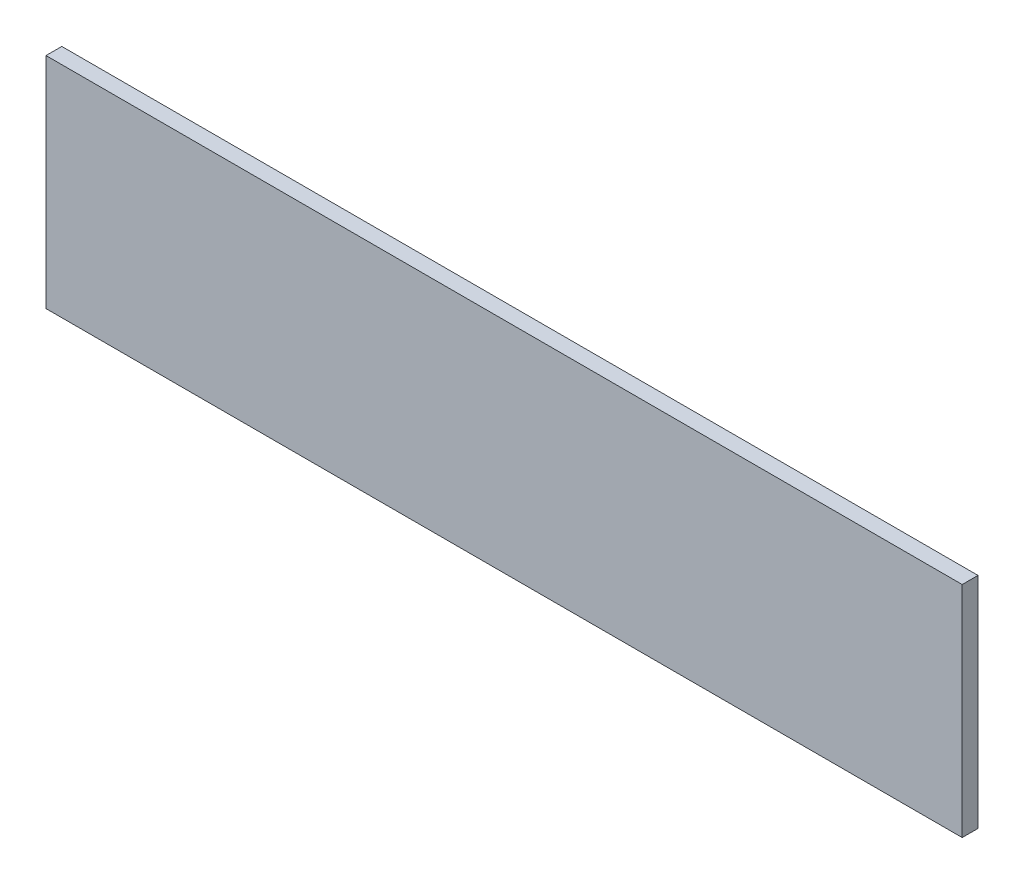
from build123d import *

# Parameters (mm, degrees)
ESQUISSE1_W        = 580
ESQUISSE1_H        = 138.74
BOSS_EXTRU_1_DEPTH = 10


with BuildPart() as part:
    # Esquisse1 → Boss.-Extru.1 (new body)
    with BuildSketch(Plane.XY):
        with Locations((217.456259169, -47.664599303)):
            Rectangle(ESQUISSE1_W, ESQUISSE1_H)
    extrude(amount=BOSS_EXTRU_1_DEPTH)


solid = part.part
